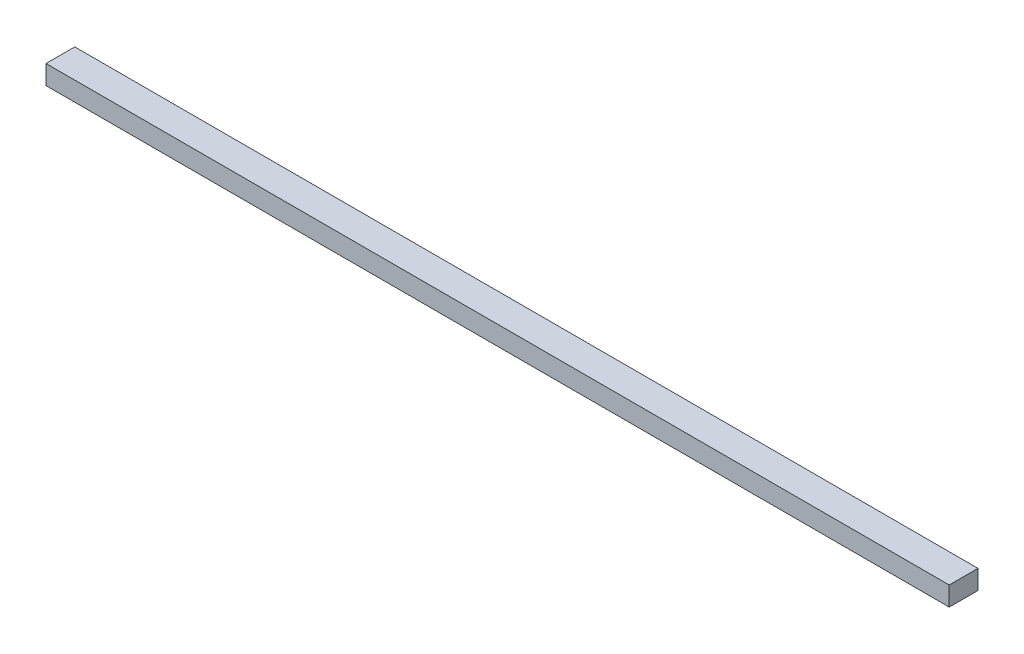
ISO-10303-21;
HEADER;
FILE_DESCRIPTION(('STEP AP214'),'2;1');
FILE_NAME('part.step','',(''),(''),'','','');
FILE_SCHEMA(('AUTOMOTIVE_DESIGN { 1 0 10303 214 1 1 1 1 }'));
ENDSEC;
DATA;
#1=APPLICATION_CONTEXT('core data for automotive mechanical design processes');
#2=APPLICATION_PROTOCOL_DEFINITION('international standard','automotive_design',2000,#1);
#3=PRODUCT_CONTEXT('',#1,'mechanical');
#4=PRODUCT('Part','Part','',(#3));
#5=PRODUCT_RELATED_PRODUCT_CATEGORY('part','',(#4));
#6=PRODUCT_DEFINITION_FORMATION('','',#4);
#7=PRODUCT_DEFINITION_CONTEXT('part definition',#1,'design');
#8=PRODUCT_DEFINITION('design','',#6,#7);
#9=PRODUCT_DEFINITION_SHAPE('','',#8);
#10=(LENGTH_UNIT() NAMED_UNIT(*) SI_UNIT(.MILLI.,.METRE.));
#11=(NAMED_UNIT(*) PLANE_ANGLE_UNIT() SI_UNIT($,.RADIAN.));
#12=(NAMED_UNIT(*) SI_UNIT($,.STERADIAN.) SOLID_ANGLE_UNIT());
#13=UNCERTAINTY_MEASURE_WITH_UNIT(LENGTH_MEASURE(1.E-05),#10,'distance_accuracy_value','');
#14=(GEOMETRIC_REPRESENTATION_CONTEXT(3) GLOBAL_UNCERTAINTY_ASSIGNED_CONTEXT((#13)) GLOBAL_UNIT_ASSIGNED_CONTEXT((#10,
#11,#12)) REPRESENTATION_CONTEXT('',''));
#15=CARTESIAN_POINT('',(0.,0.,0.));
#16=DIRECTION('',(0.,0.,1.));
#17=DIRECTION('',(1.,0.,0.));
#18=AXIS2_PLACEMENT_3D('',#15,#16,#17);
#19=CARTESIAN_POINT('',(471.,0.,0.));
#20=DIRECTION('',(0.,0.,-1.));
#21=DIRECTION('',(-1.,0.,0.));
#22=AXIS2_PLACEMENT_3D('',#19,#20,#21);
#23=PLANE('',#22);
#24=DIRECTION('',(0.,-1.,0.));
#25=VECTOR('',#24,1.);
#26=CARTESIAN_POINT('',(-471.,0.,0.));
#27=LINE('',#26,#25);
#28=CARTESIAN_POINT('',(-471.,20.,0.));
#29=VERTEX_POINT('',#28);
#30=CARTESIAN_POINT('',(-471.,0.,0.));
#31=VERTEX_POINT('',#30);
#32=EDGE_CURVE('E99',#29,#31,#27,.T.);
#33=ORIENTED_EDGE('',*,*,#32,.T.);
#34=DIRECTION('',(-1.,0.,0.));
#35=VECTOR('',#34,1.);
#36=CARTESIAN_POINT('',(471.,0.,0.));
#37=LINE('',#36,#35);
#38=CARTESIAN_POINT('',(471.,0.,0.));
#39=VERTEX_POINT('',#38);
#40=EDGE_CURVE('E11',#39,#31,#37,.T.);
#41=ORIENTED_EDGE('',*,*,#40,.F.);
#42=DIRECTION('',(0.,-1.,0.));
#43=VECTOR('',#42,1.);
#44=CARTESIAN_POINT('',(471.,0.,0.));
#45=LINE('',#44,#43);
#46=CARTESIAN_POINT('',(471.,20.,0.));
#47=VERTEX_POINT('',#46);
#48=EDGE_CURVE('E86',#47,#39,#45,.T.);
#49=ORIENTED_EDGE('',*,*,#48,.F.);
#50=DIRECTION('',(-1.,0.,0.));
#51=VECTOR('',#50,1.);
#52=CARTESIAN_POINT('',(471.,20.,0.));
#53=LINE('',#52,#51);
#54=EDGE_CURVE('E95',#47,#29,#53,.T.);
#55=ORIENTED_EDGE('',*,*,#54,.T.);
#56=EDGE_LOOP('',(#33,#41,#49,#55));
#57=FACE_BOUND('',#56,.T.);
#58=ADVANCED_FACE('F34',(#57),#23,.F.);
#59=CARTESIAN_POINT('',(471.,0.,0.));
#60=DIRECTION('',(0.,1.,0.));
#61=DIRECTION('',(0.,0.,1.));
#62=AXIS2_PLACEMENT_3D('',#59,#60,#61);
#63=PLANE('',#62);
#64=DIRECTION('',(0.,0.,-1.));
#65=VECTOR('',#64,1.);
#66=CARTESIAN_POINT('',(-471.,0.,0.));
#67=LINE('',#66,#65);
#68=CARTESIAN_POINT('',(-471.,0.,-30.));
#69=VERTEX_POINT('',#68);
#70=EDGE_CURVE('E90',#31,#69,#67,.T.);
#71=ORIENTED_EDGE('',*,*,#70,.T.);
#72=DIRECTION('',(-1.,0.,0.));
#73=VECTOR('',#72,1.);
#74=CARTESIAN_POINT('',(471.,0.,-30.));
#75=LINE('',#74,#73);
#76=CARTESIAN_POINT('',(471.,0.,-30.));
#77=VERTEX_POINT('',#76);
#78=EDGE_CURVE('E43',#77,#69,#75,.T.);
#79=ORIENTED_EDGE('',*,*,#78,.F.);
#80=DIRECTION('',(0.,0.,-1.));
#81=VECTOR('',#80,1.);
#82=CARTESIAN_POINT('',(471.,0.,0.));
#83=LINE('',#82,#81);
#84=EDGE_CURVE('E81',#39,#77,#83,.T.);
#85=ORIENTED_EDGE('',*,*,#84,.F.);
#86=ORIENTED_EDGE('',*,*,#40,.T.);
#87=EDGE_LOOP('',(#71,#79,#85,#86));
#88=FACE_BOUND('',#87,.T.);
#89=ADVANCED_FACE('F89',(#88),#63,.F.);
#90=CARTESIAN_POINT('',(471.,0.,-30.));
#91=DIRECTION('',(0.,0.,1.));
#92=DIRECTION('',(1.,0.,0.));
#93=AXIS2_PLACEMENT_3D('',#90,#91,#92);
#94=PLANE('',#93);
#95=DIRECTION('',(0.,1.,0.));
#96=VECTOR('',#95,1.);
#97=CARTESIAN_POINT('',(-471.,0.,-30.));
#98=LINE('',#97,#96);
#99=CARTESIAN_POINT('',(-471.,20.,-30.));
#100=VERTEX_POINT('',#99);
#101=EDGE_CURVE('E68',#69,#100,#98,.T.);
#102=ORIENTED_EDGE('',*,*,#101,.T.);
#103=DIRECTION('',(-1.,0.,0.));
#104=VECTOR('',#103,1.);
#105=CARTESIAN_POINT('',(471.,20.,-30.));
#106=LINE('',#105,#104);
#107=CARTESIAN_POINT('',(471.,20.,-30.));
#108=VERTEX_POINT('',#107);
#109=EDGE_CURVE('E92',#108,#100,#106,.T.);
#110=ORIENTED_EDGE('',*,*,#109,.F.);
#111=DIRECTION('',(0.,1.,0.));
#112=VECTOR('',#111,1.);
#113=CARTESIAN_POINT('',(471.,0.,-30.));
#114=LINE('',#113,#112);
#115=EDGE_CURVE('E84',#77,#108,#114,.T.);
#116=ORIENTED_EDGE('',*,*,#115,.F.);
#117=ORIENTED_EDGE('',*,*,#78,.T.);
#118=EDGE_LOOP('',(#102,#110,#116,#117));
#119=FACE_BOUND('',#118,.T.);
#120=ADVANCED_FACE('F93',(#119),#94,.F.);
#121=CARTESIAN_POINT('',(471.,20.,0.));
#122=DIRECTION('',(0.,-1.,0.));
#123=DIRECTION('',(0.,0.,-1.));
#124=AXIS2_PLACEMENT_3D('',#121,#122,#123);
#125=PLANE('',#124);
#126=DIRECTION('',(0.,0.,1.));
#127=VECTOR('',#126,1.);
#128=CARTESIAN_POINT('',(-471.,20.,0.));
#129=LINE('',#128,#127);
#130=EDGE_CURVE('E74',#100,#29,#129,.T.);
#131=ORIENTED_EDGE('',*,*,#130,.T.);
#132=ORIENTED_EDGE('',*,*,#54,.F.);
#133=DIRECTION('',(0.,0.,1.));
#134=VECTOR('',#133,1.);
#135=CARTESIAN_POINT('',(471.,20.,0.));
#136=LINE('',#135,#134);
#137=EDGE_CURVE('E51',#108,#47,#136,.T.);
#138=ORIENTED_EDGE('',*,*,#137,.F.);
#139=ORIENTED_EDGE('',*,*,#109,.T.);
#140=EDGE_LOOP('',(#131,#132,#138,#139));
#141=FACE_BOUND('',#140,.T.);
#142=ADVANCED_FACE('F108',(#141),#125,.F.);
#143=CARTESIAN_POINT('',(471.,0.,0.));
#144=DIRECTION('',(-1.,0.,0.));
#145=DIRECTION('',(0.,0.,1.));
#146=AXIS2_PLACEMENT_3D('',#143,#144,#145);
#147=PLANE('',#146);
#148=ORIENTED_EDGE('',*,*,#48,.T.);
#149=ORIENTED_EDGE('',*,*,#84,.T.);
#150=ORIENTED_EDGE('',*,*,#115,.T.);
#151=ORIENTED_EDGE('',*,*,#137,.T.);
#152=EDGE_LOOP('',(#148,#149,#150,#151));
#153=FACE_BOUND('',#152,.T.);
#154=ADVANCED_FACE('F82',(#153),#147,.F.);
#155=CARTESIAN_POINT('',(-471.,0.,0.));
#156=DIRECTION('',(-1.,0.,0.));
#157=DIRECTION('',(0.,0.,1.));
#158=AXIS2_PLACEMENT_3D('',#155,#156,#157);
#159=PLANE('',#158);
#160=ORIENTED_EDGE('',*,*,#32,.F.);
#161=ORIENTED_EDGE('',*,*,#130,.F.);
#162=ORIENTED_EDGE('',*,*,#101,.F.);
#163=ORIENTED_EDGE('',*,*,#70,.F.);
#164=EDGE_LOOP('',(#160,#161,#162,#163));
#165=FACE_BOUND('',#164,.T.);
#166=ADVANCED_FACE('F111',(#165),#159,.T.);
#167=CLOSED_SHELL('',(#58,#89,#120,#142,#154,#166));
#168=MANIFOLD_SOLID_BREP('B2',#167);
#169=ADVANCED_BREP_SHAPE_REPRESENTATION('',(#18,#168),#14);
#170=SHAPE_DEFINITION_REPRESENTATION(#9,#169);
ENDSEC;
END-ISO-10303-21;
